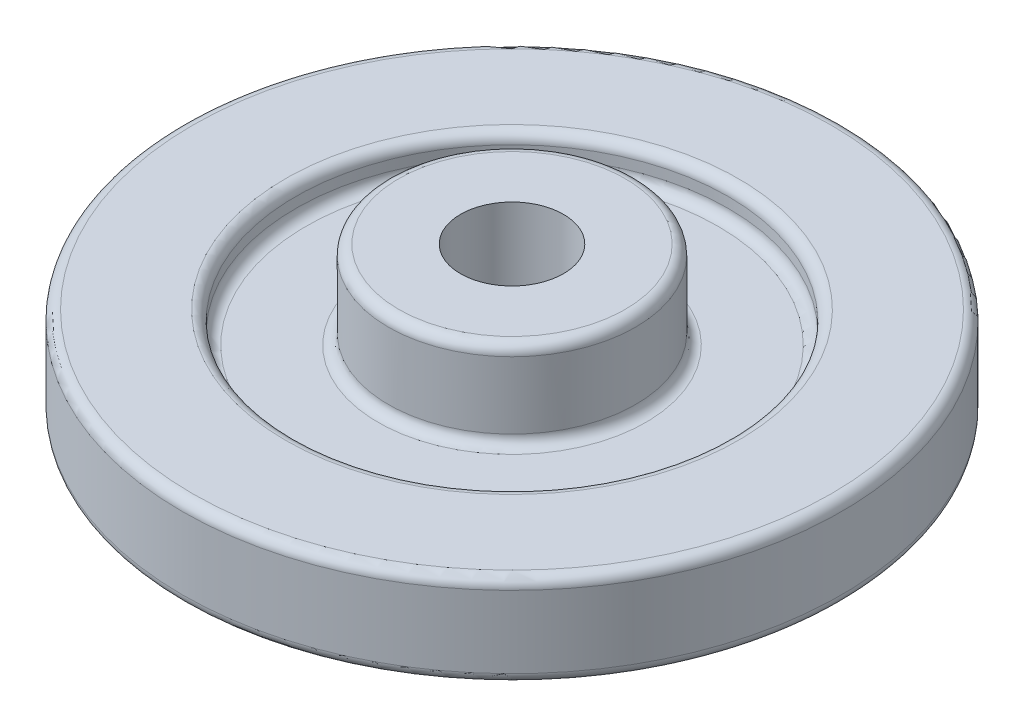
ISO-10303-21;
HEADER;
FILE_DESCRIPTION(('STEP AP214'),'2;1');
FILE_NAME('part.step','',(''),(''),'','','');
FILE_SCHEMA(('AUTOMOTIVE_DESIGN { 1 0 10303 214 1 1 1 1 }'));
ENDSEC;
DATA;
#1=APPLICATION_CONTEXT('core data for automotive mechanical design processes');
#2=APPLICATION_PROTOCOL_DEFINITION('international standard','automotive_design',2000,#1);
#3=PRODUCT_CONTEXT('',#1,'mechanical');
#4=PRODUCT('Part','Part','',(#3));
#5=PRODUCT_RELATED_PRODUCT_CATEGORY('part','',(#4));
#6=PRODUCT_DEFINITION_FORMATION('','',#4);
#7=PRODUCT_DEFINITION_CONTEXT('part definition',#1,'design');
#8=PRODUCT_DEFINITION('design','',#6,#7);
#9=PRODUCT_DEFINITION_SHAPE('','',#8);
#10=(LENGTH_UNIT() NAMED_UNIT(*) SI_UNIT(.MILLI.,.METRE.));
#11=(NAMED_UNIT(*) PLANE_ANGLE_UNIT() SI_UNIT($,.RADIAN.));
#12=(NAMED_UNIT(*) SI_UNIT($,.STERADIAN.) SOLID_ANGLE_UNIT());
#13=UNCERTAINTY_MEASURE_WITH_UNIT(LENGTH_MEASURE(1.E-05),#10,'distance_accuracy_value','');
#14=(GEOMETRIC_REPRESENTATION_CONTEXT(3) GLOBAL_UNCERTAINTY_ASSIGNED_CONTEXT((#13)) GLOBAL_UNIT_ASSIGNED_CONTEXT((#10,
#11,#12)) REPRESENTATION_CONTEXT('',''));
#15=CARTESIAN_POINT('',(0.,0.,0.));
#16=DIRECTION('',(0.,0.,1.));
#17=DIRECTION('',(1.,0.,0.));
#18=AXIS2_PLACEMENT_3D('',#15,#16,#17);
#19=CARTESIAN_POINT('',(0.,0.,0.));
#20=DIRECTION('',(0.,-1.,0.));
#21=DIRECTION('',(0.,0.,-1.));
#22=AXIS2_PLACEMENT_3D('',#19,#20,#21);
#23=PLANE('',#22);
#24=CARTESIAN_POINT('',(0.,0.,0.));
#25=DIRECTION('',(0.,-1.,0.));
#26=DIRECTION('',(0.,0.,-1.));
#27=AXIS2_PLACEMENT_3D('',#24,#25,#26);
#28=CIRCLE('',#27,38.1);
#29=CARTESIAN_POINT('',(0.,0.,-38.1));
#30=VERTEX_POINT('',#29);
#31=EDGE_CURVE('E91',#30,#30,#28,.T.);
#32=ORIENTED_EDGE('',*,*,#31,.T.);
#33=EDGE_LOOP('',(#32));
#34=FACE_BOUND('',#33,.T.);
#35=CARTESIAN_POINT('',(0.,0.,0.));
#36=DIRECTION('',(0.,1.,0.));
#37=DIRECTION('',(0.,0.,1.));
#38=AXIS2_PLACEMENT_3D('',#35,#36,#37);
#39=CIRCLE('',#38,15.875);
#40=CARTESIAN_POINT('',(0.,0.,15.875));
#41=VERTEX_POINT('',#40);
#42=EDGE_CURVE('E82',#41,#41,#39,.T.);
#43=ORIENTED_EDGE('',*,*,#42,.T.);
#44=EDGE_LOOP('',(#43));
#45=FACE_BOUND('',#44,.T.);
#46=ADVANCED_FACE('F26',(#34,#45),#23,.T.);
#47=CARTESIAN_POINT('',(0.,0.,0.));
#48=DIRECTION('',(0.,-1.,0.));
#49=DIRECTION('',(0.,0.,-1.));
#50=AXIS2_PLACEMENT_3D('',#47,#48,#49);
#51=CIRCLE('',#50,98.425);
#52=CARTESIAN_POINT('',(0.,0.,-98.425));
#53=VERTEX_POINT('',#52);
#54=EDGE_CURVE('E10',#53,#53,#51,.T.);
#55=ORIENTED_EDGE('',*,*,#54,.T.);
#56=EDGE_LOOP('',(#55));
#57=FACE_BOUND('',#56,.T.);
#58=CARTESIAN_POINT('',(0.,0.,0.));
#59=DIRECTION('',(0.,-1.,0.));
#60=DIRECTION('',(0.,0.,-1.));
#61=AXIS2_PLACEMENT_3D('',#58,#59,#60);
#62=CIRCLE('',#61,65.0875);
#63=CARTESIAN_POINT('',(0.,0.,-65.0875));
#64=VERTEX_POINT('',#63);
#65=EDGE_CURVE('E33',#64,#64,#62,.F.);
#66=ORIENTED_EDGE('',*,*,#65,.T.);
#67=EDGE_LOOP('',(#66));
#68=FACE_BOUND('',#67,.T.);
#69=ADVANCED_FACE('F28',(#57,#68),#23,.T.);
#70=CARTESIAN_POINT('',(0.,0.,0.));
#71=DIRECTION('',(0.,-1.,0.));
#72=DIRECTION('',(0.,0.,-1.));
#73=AXIS2_PLACEMENT_3D('',#70,#71,#72);
#74=CYLINDRICAL_SURFACE('',#73,101.6);
#75=CARTESIAN_POINT('',(0.,25.4,0.));
#76=DIRECTION('',(0.,1.,0.));
#77=DIRECTION('',(0.,0.,1.));
#78=AXIS2_PLACEMENT_3D('',#75,#76,#77);
#79=CIRCLE('',#78,101.6);
#80=CARTESIAN_POINT('',(0.,25.4,101.6));
#81=VERTEX_POINT('',#80);
#82=EDGE_CURVE('E37',#81,#81,#79,.F.);
#83=ORIENTED_EDGE('',*,*,#82,.T.);
#84=EDGE_LOOP('',(#83));
#85=FACE_BOUND('',#84,.T.);
#86=CARTESIAN_POINT('',(0.,3.175,0.));
#87=DIRECTION('',(0.,-1.,0.));
#88=DIRECTION('',(0.,0.,-1.));
#89=AXIS2_PLACEMENT_3D('',#86,#87,#88);
#90=CIRCLE('',#89,101.6);
#91=CARTESIAN_POINT('',(0.,3.175,-101.6));
#92=VERTEX_POINT('',#91);
#93=EDGE_CURVE('E41',#92,#92,#90,.F.);
#94=ORIENTED_EDGE('',*,*,#93,.T.);
#95=EDGE_LOOP('',(#94));
#96=FACE_BOUND('',#95,.T.);
#97=ADVANCED_FACE('F121',(#85,#96),#74,.T.);
#98=CARTESIAN_POINT('',(101.6,28.575,0.));
#99=DIRECTION('',(0.,1.,0.));
#100=DIRECTION('',(0.,0.,1.));
#101=AXIS2_PLACEMENT_3D('',#98,#99,#100);
#102=PLANE('',#101);
#103=CARTESIAN_POINT('',(0.,28.575,0.));
#104=DIRECTION('',(0.,1.,0.));
#105=DIRECTION('',(0.,0.,1.));
#106=AXIS2_PLACEMENT_3D('',#103,#104,#105);
#107=CIRCLE('',#106,69.85);
#108=CARTESIAN_POINT('',(0.,28.575,69.85));
#109=VERTEX_POINT('',#108);
#110=EDGE_CURVE('E46',#109,#109,#107,.F.);
#111=ORIENTED_EDGE('',*,*,#110,.T.);
#112=EDGE_LOOP('',(#111));
#113=FACE_BOUND('',#112,.T.);
#114=CARTESIAN_POINT('',(0.,28.575,0.));
#115=DIRECTION('',(0.,1.,0.));
#116=DIRECTION('',(0.,0.,1.));
#117=AXIS2_PLACEMENT_3D('',#114,#115,#116);
#118=CIRCLE('',#117,98.425);
#119=CARTESIAN_POINT('',(0.,28.575,98.425));
#120=VERTEX_POINT('',#119);
#121=EDGE_CURVE('E49',#120,#120,#118,.T.);
#122=ORIENTED_EDGE('',*,*,#121,.T.);
#123=EDGE_LOOP('',(#122));
#124=FACE_BOUND('',#123,.T.);
#125=ADVANCED_FACE('F125',(#113,#124),#102,.T.);
#126=CARTESIAN_POINT('',(0.,0.,0.));
#127=DIRECTION('',(0.,-1.,0.));
#128=DIRECTION('',(0.,0.,-1.));
#129=AXIS2_PLACEMENT_3D('',#126,#127,#128);
#130=CYLINDRICAL_SURFACE('',#129,38.1);
#131=CARTESIAN_POINT('',(0.,42.8752,0.));
#132=DIRECTION('',(0.,1.,0.));
#133=DIRECTION('',(0.,0.,1.));
#134=AXIS2_PLACEMENT_3D('',#131,#132,#133);
#135=CIRCLE('',#134,38.1);
#136=CARTESIAN_POINT('',(0.,42.8752,38.1));
#137=VERTEX_POINT('',#136);
#138=EDGE_CURVE('E67',#137,#137,#135,.F.);
#139=ORIENTED_EDGE('',*,*,#138,.T.);
#140=EDGE_LOOP('',(#139));
#141=FACE_BOUND('',#140,.T.);
#142=CARTESIAN_POINT('',(0.,22.225,0.));
#143=DIRECTION('',(0.,-1.,0.));
#144=DIRECTION('',(0.,0.,-1.));
#145=AXIS2_PLACEMENT_3D('',#142,#143,#144);
#146=CIRCLE('',#145,38.1);
#147=CARTESIAN_POINT('',(0.,22.225,-38.1));
#148=VERTEX_POINT('',#147);
#149=EDGE_CURVE('E70',#148,#148,#146,.F.);
#150=ORIENTED_EDGE('',*,*,#149,.T.);
#151=EDGE_LOOP('',(#150));
#152=FACE_BOUND('',#151,.T.);
#153=ADVANCED_FACE('F130',(#141,#152),#130,.T.);
#154=CARTESIAN_POINT('',(38.1,46.0502,0.));
#155=DIRECTION('',(0.,1.,0.));
#156=DIRECTION('',(0.,0.,1.));
#157=AXIS2_PLACEMENT_3D('',#154,#155,#156);
#158=PLANE('',#157);
#159=CARTESIAN_POINT('',(0.,46.0502,0.));
#160=DIRECTION('',(0.,1.,0.));
#161=DIRECTION('',(0.,0.,1.));
#162=AXIS2_PLACEMENT_3D('',#159,#160,#161);
#163=CIRCLE('',#162,34.925);
#164=CARTESIAN_POINT('',(0.,46.0502,34.925));
#165=VERTEX_POINT('',#164);
#166=EDGE_CURVE('E64',#165,#165,#163,.T.);
#167=ORIENTED_EDGE('',*,*,#166,.T.);
#168=EDGE_LOOP('',(#167));
#169=FACE_BOUND('',#168,.T.);
#170=CARTESIAN_POINT('',(0.,46.0502,0.));
#171=DIRECTION('',(0.,1.,0.));
#172=DIRECTION('',(0.,0.,1.));
#173=AXIS2_PLACEMENT_3D('',#170,#171,#172);
#174=CIRCLE('',#173,15.875);
#175=CARTESIAN_POINT('',(0.,46.0502,15.875));
#176=VERTEX_POINT('',#175);
#177=EDGE_CURVE('E85',#176,#176,#174,.T.);
#178=ORIENTED_EDGE('',*,*,#177,.F.);
#179=EDGE_LOOP('',(#178));
#180=FACE_BOUND('',#179,.T.);
#181=ADVANCED_FACE('F137',(#169,#180),#158,.T.);
#182=CARTESIAN_POINT('',(0.,0.,0.));
#183=DIRECTION('',(0.,1.,0.));
#184=DIRECTION('',(0.,0.,1.));
#185=AXIS2_PLACEMENT_3D('',#182,#183,#184);
#186=CYLINDRICAL_SURFACE('',#185,15.875);
#187=ORIENTED_EDGE('',*,*,#42,.F.);
#188=EDGE_LOOP('',(#187));
#189=FACE_BOUND('',#188,.T.);
#190=ORIENTED_EDGE('',*,*,#177,.T.);
#191=EDGE_LOOP('',(#190));
#192=FACE_BOUND('',#191,.T.);
#193=ADVANCED_FACE('F141',(#189,#192),#186,.F.);
#194=CARTESIAN_POINT('',(38.1,19.05,0.));
#195=DIRECTION('',(0.,-1.,0.));
#196=DIRECTION('',(0.,0.,-1.));
#197=AXIS2_PLACEMENT_3D('',#194,#195,#196);
#198=PLANE('',#197);
#199=CARTESIAN_POINT('',(0.,19.05,0.));
#200=DIRECTION('',(0.,-1.,0.));
#201=DIRECTION('',(0.,0.,-1.));
#202=AXIS2_PLACEMENT_3D('',#199,#200,#201);
#203=CIRCLE('',#202,41.275);
#204=CARTESIAN_POINT('',(0.,19.05,-41.275));
#205=VERTEX_POINT('',#204);
#206=EDGE_CURVE('E58',#205,#205,#203,.T.);
#207=ORIENTED_EDGE('',*,*,#206,.T.);
#208=EDGE_LOOP('',(#207));
#209=FACE_BOUND('',#208,.T.);
#210=CARTESIAN_POINT('',(0.,19.05,0.));
#211=DIRECTION('',(0.,-1.,0.));
#212=DIRECTION('',(0.,0.,-1.));
#213=AXIS2_PLACEMENT_3D('',#210,#211,#212);
#214=CIRCLE('',#213,63.5);
#215=CARTESIAN_POINT('',(0.,19.05,-63.5));
#216=VERTEX_POINT('',#215);
#217=EDGE_CURVE('E61',#216,#216,#214,.F.);
#218=ORIENTED_EDGE('',*,*,#217,.T.);
#219=EDGE_LOOP('',(#218));
#220=FACE_BOUND('',#219,.T.);
#221=ADVANCED_FACE('F113',(#209,#220),#198,.F.);
#222=CARTESIAN_POINT('',(0.,0.,0.));
#223=DIRECTION('',(0.,-1.,0.));
#224=DIRECTION('',(0.,0.,-1.));
#225=AXIS2_PLACEMENT_3D('',#222,#223,#224);
#226=CYLINDRICAL_SURFACE('',#225,66.675);
#227=CARTESIAN_POINT('',(0.,22.225,0.));
#228=DIRECTION('',(0.,-1.,0.));
#229=DIRECTION('',(0.,0.,-1.));
#230=AXIS2_PLACEMENT_3D('',#227,#228,#229);
#231=CIRCLE('',#230,66.675);
#232=CARTESIAN_POINT('',(0.,22.225,-66.675));
#233=VERTEX_POINT('',#232);
#234=EDGE_CURVE('E52',#233,#233,#231,.T.);
#235=ORIENTED_EDGE('',*,*,#234,.T.);
#236=EDGE_LOOP('',(#235));
#237=FACE_BOUND('',#236,.T.);
#238=CARTESIAN_POINT('',(0.,25.4,0.));
#239=DIRECTION('',(0.,1.,0.));
#240=DIRECTION('',(0.,0.,1.));
#241=AXIS2_PLACEMENT_3D('',#238,#239,#240);
#242=CIRCLE('',#241,66.675);
#243=CARTESIAN_POINT('',(0.,25.4,66.675));
#244=VERTEX_POINT('',#243);
#245=EDGE_CURVE('E55',#244,#244,#242,.T.);
#246=ORIENTED_EDGE('',*,*,#245,.T.);
#247=EDGE_LOOP('',(#246));
#248=FACE_BOUND('',#247,.T.);
#249=ADVANCED_FACE('F106',(#237,#248),#226,.F.);
#250=CARTESIAN_POINT('',(61.9125,9.525,0.));
#251=DIRECTION('',(0.,1.,0.));
#252=DIRECTION('',(0.,0.,1.));
#253=AXIS2_PLACEMENT_3D('',#250,#251,#252);
#254=PLANE('',#253);
#255=CARTESIAN_POINT('',(0.,9.525,0.));
#256=DIRECTION('',(0.,1.,0.));
#257=DIRECTION('',(0.,0.,1.));
#258=AXIS2_PLACEMENT_3D('',#255,#256,#257);
#259=CIRCLE('',#258,58.7375);
#260=CARTESIAN_POINT('',(0.,9.525,58.7375));
#261=VERTEX_POINT('',#260);
#262=EDGE_CURVE('E79',#261,#261,#259,.F.);
#263=ORIENTED_EDGE('',*,*,#262,.T.);
#264=EDGE_LOOP('',(#263));
#265=FACE_BOUND('',#264,.T.);
#266=CARTESIAN_POINT('',(0.,9.525,0.));
#267=DIRECTION('',(0.,-1.,0.));
#268=DIRECTION('',(0.,0.,-1.));
#269=AXIS2_PLACEMENT_3D('',#266,#267,#268);
#270=CIRCLE('',#269,38.1);
#271=CARTESIAN_POINT('',(0.,9.525,-38.1));
#272=VERTEX_POINT('',#271);
#273=EDGE_CURVE('E88',#272,#272,#270,.T.);
#274=ORIENTED_EDGE('',*,*,#273,.F.);
#275=EDGE_LOOP('',(#274));
#276=FACE_BOUND('',#275,.T.);
#277=ADVANCED_FACE('F101',(#265,#276),#254,.F.);
#278=CARTESIAN_POINT('',(0.,0.,0.));
#279=DIRECTION('',(0.,-1.,0.));
#280=DIRECTION('',(0.,0.,-1.));
#281=AXIS2_PLACEMENT_3D('',#278,#279,#280);
#282=CYLINDRICAL_SURFACE('',#281,38.1);
#283=ORIENTED_EDGE('',*,*,#31,.F.);
#284=EDGE_LOOP('',(#283));
#285=FACE_BOUND('',#284,.T.);
#286=ORIENTED_EDGE('',*,*,#273,.T.);
#287=EDGE_LOOP('',(#286));
#288=FACE_BOUND('',#287,.T.);
#289=ADVANCED_FACE('F97',(#285,#288),#282,.T.);
#290=CARTESIAN_POINT('',(0.,0.,0.));
#291=DIRECTION('',(0.,-1.,0.));
#292=DIRECTION('',(0.,0.,-1.));
#293=AXIS2_PLACEMENT_3D('',#290,#291,#292);
#294=CYLINDRICAL_SURFACE('',#293,61.9125);
#295=CARTESIAN_POINT('',(0.,6.35,0.));
#296=DIRECTION('',(0.,1.,0.));
#297=DIRECTION('',(0.,0.,1.));
#298=AXIS2_PLACEMENT_3D('',#295,#296,#297);
#299=CIRCLE('',#298,61.9125);
#300=CARTESIAN_POINT('',(0.,6.35,61.9125));
#301=VERTEX_POINT('',#300);
#302=EDGE_CURVE('E73',#301,#301,#299,.T.);
#303=ORIENTED_EDGE('',*,*,#302,.T.);
#304=EDGE_LOOP('',(#303));
#305=FACE_BOUND('',#304,.T.);
#306=CARTESIAN_POINT('',(0.,3.175,0.));
#307=DIRECTION('',(0.,-1.,0.));
#308=DIRECTION('',(0.,0.,-1.));
#309=AXIS2_PLACEMENT_3D('',#306,#307,#308);
#310=CIRCLE('',#309,61.9125);
#311=CARTESIAN_POINT('',(0.,3.175,-61.9125));
#312=VERTEX_POINT('',#311);
#313=EDGE_CURVE('E76',#312,#312,#310,.T.);
#314=ORIENTED_EDGE('',*,*,#313,.T.);
#315=EDGE_LOOP('',(#314));
#316=FACE_BOUND('',#315,.T.);
#317=ADVANCED_FACE('F100',(#305,#316),#294,.F.);
#318=CARTESIAN_POINT('',(0.,6.35,0.));
#319=DIRECTION('',(0.,1.,0.));
#320=DIRECTION('',(0.,0.,1.));
#321=AXIS2_PLACEMENT_3D('',#318,#319,#320);
#322=TOROIDAL_SURFACE('',#321,58.7375,3.175);
#323=ORIENTED_EDGE('',*,*,#302,.F.);
#324=EDGE_LOOP('',(#323));
#325=FACE_BOUND('',#324,.T.);
#326=ORIENTED_EDGE('',*,*,#262,.F.);
#327=EDGE_LOOP('',(#326));
#328=FACE_BOUND('',#327,.T.);
#329=ADVANCED_FACE('F190',(#325,#328),#322,.F.);
#330=CARTESIAN_POINT('',(0.,42.8752,0.));
#331=DIRECTION('',(0.,1.,0.));
#332=DIRECTION('',(0.,0.,1.));
#333=AXIS2_PLACEMENT_3D('',#330,#331,#332);
#334=TOROIDAL_SURFACE('',#333,34.925,3.175);
#335=ORIENTED_EDGE('',*,*,#166,.F.);
#336=EDGE_LOOP('',(#335));
#337=FACE_BOUND('',#336,.T.);
#338=ORIENTED_EDGE('',*,*,#138,.F.);
#339=EDGE_LOOP('',(#338));
#340=FACE_BOUND('',#339,.T.);
#341=ADVANCED_FACE('F186',(#337,#340),#334,.T.);
#342=CARTESIAN_POINT('',(0.,22.225,0.));
#343=DIRECTION('',(0.,-1.,0.));
#344=DIRECTION('',(0.,0.,-1.));
#345=AXIS2_PLACEMENT_3D('',#342,#343,#344);
#346=TOROIDAL_SURFACE('',#345,41.275,3.175);
#347=ORIENTED_EDGE('',*,*,#149,.F.);
#348=EDGE_LOOP('',(#347));
#349=FACE_BOUND('',#348,.T.);
#350=ORIENTED_EDGE('',*,*,#206,.F.);
#351=EDGE_LOOP('',(#350));
#352=FACE_BOUND('',#351,.T.);
#353=ADVANCED_FACE('F157',(#349,#352),#346,.F.);
#354=CARTESIAN_POINT('',(0.,22.225,0.));
#355=DIRECTION('',(0.,-1.,0.));
#356=DIRECTION('',(0.,0.,-1.));
#357=AXIS2_PLACEMENT_3D('',#354,#355,#356);
#358=TOROIDAL_SURFACE('',#357,63.5,3.175);
#359=ORIENTED_EDGE('',*,*,#217,.F.);
#360=EDGE_LOOP('',(#359));
#361=FACE_BOUND('',#360,.T.);
#362=ORIENTED_EDGE('',*,*,#234,.F.);
#363=EDGE_LOOP('',(#362));
#364=FACE_BOUND('',#363,.T.);
#365=ADVANCED_FACE('F153',(#361,#364),#358,.F.);
#366=CARTESIAN_POINT('',(0.,25.4,0.));
#367=DIRECTION('',(0.,1.,0.));
#368=DIRECTION('',(0.,0.,1.));
#369=AXIS2_PLACEMENT_3D('',#366,#367,#368);
#370=TOROIDAL_SURFACE('',#369,69.85,3.175);
#371=ORIENTED_EDGE('',*,*,#245,.F.);
#372=EDGE_LOOP('',(#371));
#373=FACE_BOUND('',#372,.T.);
#374=ORIENTED_EDGE('',*,*,#110,.F.);
#375=EDGE_LOOP('',(#374));
#376=FACE_BOUND('',#375,.T.);
#377=ADVANCED_FACE('F156',(#373,#376),#370,.T.);
#378=CARTESIAN_POINT('',(0.,25.4,0.));
#379=DIRECTION('',(0.,1.,0.));
#380=DIRECTION('',(0.,0.,1.));
#381=AXIS2_PLACEMENT_3D('',#378,#379,#380);
#382=TOROIDAL_SURFACE('',#381,98.425,3.175);
#383=ORIENTED_EDGE('',*,*,#121,.F.);
#384=EDGE_LOOP('',(#383));
#385=FACE_BOUND('',#384,.T.);
#386=ORIENTED_EDGE('',*,*,#82,.F.);
#387=EDGE_LOOP('',(#386));
#388=FACE_BOUND('',#387,.T.);
#389=ADVANCED_FACE('F165',(#385,#388),#382,.T.);
#390=CARTESIAN_POINT('',(0.,3.175,0.));
#391=DIRECTION('',(0.,-1.,0.));
#392=DIRECTION('',(0.,0.,-1.));
#393=AXIS2_PLACEMENT_3D('',#390,#391,#392);
#394=TOROIDAL_SURFACE('',#393,98.425,3.175);
#395=ORIENTED_EDGE('',*,*,#93,.F.);
#396=EDGE_LOOP('',(#395));
#397=FACE_BOUND('',#396,.T.);
#398=ORIENTED_EDGE('',*,*,#54,.F.);
#399=EDGE_LOOP('',(#398));
#400=FACE_BOUND('',#399,.T.);
#401=ADVANCED_FACE('F173',(#397,#400),#394,.T.);
#402=CARTESIAN_POINT('',(0.,3.175,0.));
#403=DIRECTION('',(0.,-1.,0.));
#404=DIRECTION('',(0.,0.,-1.));
#405=AXIS2_PLACEMENT_3D('',#402,#403,#404);
#406=TOROIDAL_SURFACE('',#405,65.0875,3.175);
#407=ORIENTED_EDGE('',*,*,#65,.F.);
#408=EDGE_LOOP('',(#407));
#409=FACE_BOUND('',#408,.T.);
#410=ORIENTED_EDGE('',*,*,#313,.F.);
#411=EDGE_LOOP('',(#410));
#412=FACE_BOUND('',#411,.T.);
#413=ADVANCED_FACE('F179',(#409,#412),#406,.T.);
#414=CLOSED_SHELL('',(#46,#69,#97,#125,#153,#181,#193,#221,#249,#277,#289,#317,#329,#341,#353,
#365,#377,#389,#401,#413));
#415=MANIFOLD_SOLID_BREP('B2',#414);
#416=ADVANCED_BREP_SHAPE_REPRESENTATION('',(#18,#415),#14);
#417=SHAPE_DEFINITION_REPRESENTATION(#9,#416);
ENDSEC;
END-ISO-10303-21;
